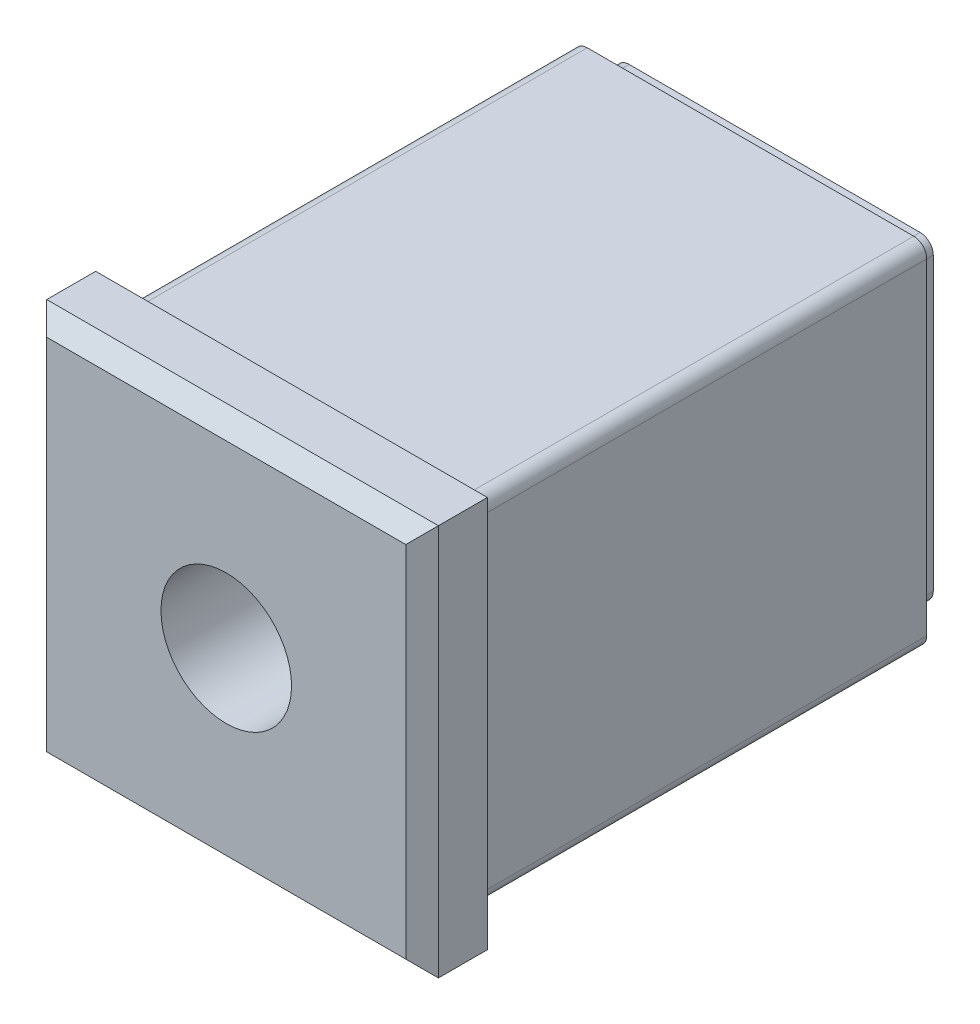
ISO-10303-21;
HEADER;
FILE_DESCRIPTION(('STEP AP214'),'2;1');
FILE_NAME('part.step','',(''),(''),'','','');
FILE_SCHEMA(('AUTOMOTIVE_DESIGN { 1 0 10303 214 1 1 1 1 }'));
ENDSEC;
DATA;
#1=APPLICATION_CONTEXT('core data for automotive mechanical design processes');
#2=APPLICATION_PROTOCOL_DEFINITION('international standard','automotive_design',2000,#1);
#3=PRODUCT_CONTEXT('',#1,'mechanical');
#4=PRODUCT('Part','Part','',(#3));
#5=PRODUCT_RELATED_PRODUCT_CATEGORY('part','',(#4));
#6=PRODUCT_DEFINITION_FORMATION('','',#4);
#7=PRODUCT_DEFINITION_CONTEXT('part definition',#1,'design');
#8=PRODUCT_DEFINITION('design','',#6,#7);
#9=PRODUCT_DEFINITION_SHAPE('','',#8);
#10=(LENGTH_UNIT() NAMED_UNIT(*) SI_UNIT(.MILLI.,.METRE.));
#11=(NAMED_UNIT(*) PLANE_ANGLE_UNIT() SI_UNIT($,.RADIAN.));
#12=(NAMED_UNIT(*) SI_UNIT($,.STERADIAN.) SOLID_ANGLE_UNIT());
#13=UNCERTAINTY_MEASURE_WITH_UNIT(LENGTH_MEASURE(1.E-05),#10,'distance_accuracy_value','');
#14=(GEOMETRIC_REPRESENTATION_CONTEXT(3) GLOBAL_UNCERTAINTY_ASSIGNED_CONTEXT((#13)) GLOBAL_UNIT_ASSIGNED_CONTEXT((#10,
#11,#12)) REPRESENTATION_CONTEXT('',''));
#15=CARTESIAN_POINT('',(0.,0.,0.));
#16=DIRECTION('',(0.,0.,1.));
#17=DIRECTION('',(1.,0.,0.));
#18=AXIS2_PLACEMENT_3D('',#15,#16,#17);
#19=CARTESIAN_POINT('',(13.75,0.,5.));
#20=DIRECTION('',(0.,0.,1.));
#21=DIRECTION('',(0.,1.,0.));
#22=AXIS2_PLACEMENT_3D('',#19,#20,#21);
#23=PLANE('',#22);
#24=DIRECTION('',(0.,-1.,0.));
#25=VECTOR('',#24,1.);
#26=CARTESIAN_POINT('',(-13.75,0.,5.));
#27=LINE('',#26,#25);
#28=CARTESIAN_POINT('',(-13.75,-13.75,5.));
#29=VERTEX_POINT('',#28);
#30=CARTESIAN_POINT('',(-13.75,13.75,5.));
#31=VERTEX_POINT('',#30);
#32=EDGE_CURVE('E237',#29,#31,#27,.F.);
#33=ORIENTED_EDGE('',*,*,#32,.F.);
#34=DIRECTION('',(-1.,0.,0.));
#35=VECTOR('',#34,1.);
#36=CARTESIAN_POINT('',(37.,-13.75,5.));
#37=LINE('',#36,#35);
#38=CARTESIAN_POINT('',(13.75,-13.75,5.));
#39=VERTEX_POINT('',#38);
#40=EDGE_CURVE('E188',#29,#39,#37,.F.);
#41=ORIENTED_EDGE('',*,*,#40,.T.);
#42=DIRECTION('',(0.,-1.,0.));
#43=VECTOR('',#42,1.);
#44=CARTESIAN_POINT('',(13.75,0.,5.));
#45=LINE('',#44,#43);
#46=CARTESIAN_POINT('',(13.75,13.75,5.));
#47=VERTEX_POINT('',#46);
#48=EDGE_CURVE('E347',#47,#39,#45,.T.);
#49=ORIENTED_EDGE('',*,*,#48,.F.);
#50=DIRECTION('',(-1.,0.,0.));
#51=VECTOR('',#50,1.);
#52=CARTESIAN_POINT('',(-30.,13.75,5.));
#53=LINE('',#52,#51);
#54=EDGE_CURVE('E360',#47,#31,#53,.T.);
#55=ORIENTED_EDGE('',*,*,#54,.T.);
#56=EDGE_LOOP('',(#33,#41,#49,#55));
#57=FACE_BOUND('',#56,.T.);
#58=CARTESIAN_POINT('',(0.,0.,5.));
#59=DIRECTION('',(0.,0.,1.));
#60=DIRECTION('',(0.,1.,0.));
#61=AXIS2_PLACEMENT_3D('',#58,#59,#60);
#62=CIRCLE('',#61,5.);
#63=CARTESIAN_POINT('',(0.,5.,5.));
#64=VERTEX_POINT('',#63);
#65=EDGE_CURVE('E191',#64,#64,#62,.F.);
#66=ORIENTED_EDGE('',*,*,#65,.T.);
#67=EDGE_LOOP('',(#66));
#68=FACE_BOUND('',#67,.T.);
#69=ADVANCED_FACE('F14',(#57,#68),#23,.T.);
#70=CARTESIAN_POINT('',(-30.,15.,3.75));
#71=DIRECTION('',(0.,-0.707106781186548,-0.707106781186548));
#72=DIRECTION('',(0.,-0.707106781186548,0.707106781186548));
#73=AXIS2_PLACEMENT_3D('',#70,#71,#72);
#74=PLANE('',#73);
#75=DIRECTION('',(-1.,0.,0.));
#76=VECTOR('',#75,1.);
#77=CARTESIAN_POINT('',(0.,15.,3.75));
#78=LINE('',#77,#76);
#79=CARTESIAN_POINT('',(15.,15.,3.75));
#80=VERTEX_POINT('',#79);
#81=CARTESIAN_POINT('',(-15.,15.,3.75));
#82=VERTEX_POINT('',#81);
#83=EDGE_CURVE('E338',#80,#82,#78,.T.);
#84=ORIENTED_EDGE('',*,*,#83,.T.);
#85=DIRECTION('',(-0.577350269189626,0.577350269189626,-0.577350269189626));
#86=VECTOR('',#85,1.);
#87=CARTESIAN_POINT('',(-13.75,13.75,5.));
#88=LINE('',#87,#86);
#89=EDGE_CURVE('E363',#31,#82,#88,.T.);
#90=ORIENTED_EDGE('',*,*,#89,.F.);
#91=ORIENTED_EDGE('',*,*,#54,.F.);
#92=DIRECTION('',(-0.577350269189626,-0.577350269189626,0.577350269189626));
#93=VECTOR('',#92,1.);
#94=CARTESIAN_POINT('',(15.,15.,3.75));
#95=LINE('',#94,#93);
#96=EDGE_CURVE('E349',#80,#47,#95,.T.);
#97=ORIENTED_EDGE('',*,*,#96,.F.);
#98=EDGE_LOOP('',(#84,#90,#91,#97));
#99=FACE_BOUND('',#98,.T.);
#100=ADVANCED_FACE('F441',(#99),#74,.F.);
#101=CARTESIAN_POINT('',(-13.75,0.,5.));
#102=DIRECTION('',(-0.707106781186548,0.,0.707106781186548));
#103=DIRECTION('',(-0.707106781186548,0.,-0.707106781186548));
#104=AXIS2_PLACEMENT_3D('',#101,#102,#103);
#105=PLANE('',#104);
#106=DIRECTION('',(0.,1.,0.));
#107=VECTOR('',#106,1.);
#108=CARTESIAN_POINT('',(-15.,0.,3.75));
#109=LINE('',#108,#107);
#110=CARTESIAN_POINT('',(-15.,-15.,3.75));
#111=VERTEX_POINT('',#110);
#112=EDGE_CURVE('E18',#111,#82,#109,.T.);
#113=ORIENTED_EDGE('',*,*,#112,.F.);
#114=DIRECTION('',(0.577350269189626,0.577350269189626,0.577350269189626));
#115=VECTOR('',#114,1.);
#116=CARTESIAN_POINT('',(-15.,-15.,3.75));
#117=LINE('',#116,#115);
#118=EDGE_CURVE('E164',#111,#29,#117,.T.);
#119=ORIENTED_EDGE('',*,*,#118,.T.);
#120=ORIENTED_EDGE('',*,*,#32,.T.);
#121=ORIENTED_EDGE('',*,*,#89,.T.);
#122=EDGE_LOOP('',(#113,#119,#120,#121));
#123=FACE_BOUND('',#122,.T.);
#124=ADVANCED_FACE('F443',(#123),#105,.T.);
#125=CARTESIAN_POINT('',(15.,0.,3.75));
#126=DIRECTION('',(0.707106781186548,0.,0.707106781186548));
#127=DIRECTION('',(-0.707106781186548,0.,0.707106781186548));
#128=AXIS2_PLACEMENT_3D('',#125,#126,#127);
#129=PLANE('',#128);
#130=ORIENTED_EDGE('',*,*,#48,.T.);
#131=DIRECTION('',(0.577350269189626,-0.577350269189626,-0.577350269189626));
#132=VECTOR('',#131,1.);
#133=CARTESIAN_POINT('',(13.75,-13.75,5.));
#134=LINE('',#133,#132);
#135=CARTESIAN_POINT('',(15.,-15.,3.75));
#136=VERTEX_POINT('',#135);
#137=EDGE_CURVE('E187',#39,#136,#134,.T.);
#138=ORIENTED_EDGE('',*,*,#137,.T.);
#139=DIRECTION('',(0.,-1.,0.));
#140=VECTOR('',#139,1.);
#141=CARTESIAN_POINT('',(15.,0.,3.75));
#142=LINE('',#141,#140);
#143=EDGE_CURVE('E333',#80,#136,#142,.T.);
#144=ORIENTED_EDGE('',*,*,#143,.F.);
#145=ORIENTED_EDGE('',*,*,#96,.T.);
#146=EDGE_LOOP('',(#130,#138,#144,#145));
#147=FACE_BOUND('',#146,.T.);
#148=ADVANCED_FACE('F446',(#147),#129,.T.);
#149=CARTESIAN_POINT('',(-15.,0.,-37.));
#150=DIRECTION('',(0.,0.,-1.));
#151=DIRECTION('',(0.,-1.,0.));
#152=AXIS2_PLACEMENT_3D('',#149,#150,#151);
#153=PLANE('',#152);
#154=DIRECTION('',(-1.,0.,0.));
#155=VECTOR('',#154,1.);
#156=CARTESIAN_POINT('',(-11.15,12.15,-37.));
#157=LINE('',#156,#155);
#158=CARTESIAN_POINT('',(-11.15,12.15,-37.));
#159=VERTEX_POINT('',#158);
#160=CARTESIAN_POINT('',(11.15,12.15,-37.));
#161=VERTEX_POINT('',#160);
#162=EDGE_CURVE('E322',#159,#161,#157,.F.);
#163=ORIENTED_EDGE('',*,*,#162,.T.);
#164=CARTESIAN_POINT('',(11.15,11.15,-37.));
#165=DIRECTION('',(0.,0.,1.));
#166=DIRECTION('',(0.,1.,0.));
#167=AXIS2_PLACEMENT_3D('',#164,#165,#166);
#168=CIRCLE('',#167,1.);
#169=CARTESIAN_POINT('',(12.15,11.15,-37.));
#170=VERTEX_POINT('',#169);
#171=EDGE_CURVE('E375',#161,#170,#168,.F.);
#172=ORIENTED_EDGE('',*,*,#171,.T.);
#173=DIRECTION('',(0.,1.,0.));
#174=VECTOR('',#173,1.);
#175=CARTESIAN_POINT('',(12.15,11.15,-37.));
#176=LINE('',#175,#174);
#177=CARTESIAN_POINT('',(12.15,-11.15,-37.));
#178=VERTEX_POINT('',#177);
#179=EDGE_CURVE('E327',#170,#178,#176,.F.);
#180=ORIENTED_EDGE('',*,*,#179,.T.);
#181=CARTESIAN_POINT('',(11.15,-11.15,-37.));
#182=DIRECTION('',(0.,0.,1.));
#183=DIRECTION('',(0.,1.,0.));
#184=AXIS2_PLACEMENT_3D('',#181,#182,#183);
#185=CIRCLE('',#184,1.);
#186=CARTESIAN_POINT('',(11.15,-12.15,-37.));
#187=VERTEX_POINT('',#186);
#188=EDGE_CURVE('E211',#178,#187,#185,.F.);
#189=ORIENTED_EDGE('',*,*,#188,.T.);
#190=DIRECTION('',(1.,0.,0.));
#191=VECTOR('',#190,1.);
#192=CARTESIAN_POINT('',(11.15,-12.15,-37.));
#193=LINE('',#192,#191);
#194=CARTESIAN_POINT('',(-11.15,-12.15,-37.));
#195=VERTEX_POINT('',#194);
#196=EDGE_CURVE('E181',#187,#195,#193,.F.);
#197=ORIENTED_EDGE('',*,*,#196,.T.);
#198=CARTESIAN_POINT('',(-11.15,-11.15,-37.));
#199=DIRECTION('',(0.,0.,1.));
#200=DIRECTION('',(0.,1.,0.));
#201=AXIS2_PLACEMENT_3D('',#198,#199,#200);
#202=CIRCLE('',#201,1.);
#203=CARTESIAN_POINT('',(-12.15,-11.15,-37.));
#204=VERTEX_POINT('',#203);
#205=EDGE_CURVE('E193',#195,#204,#202,.F.);
#206=ORIENTED_EDGE('',*,*,#205,.T.);
#207=DIRECTION('',(0.,-1.,0.));
#208=VECTOR('',#207,1.);
#209=CARTESIAN_POINT('',(-12.15,-11.15,-37.));
#210=LINE('',#209,#208);
#211=CARTESIAN_POINT('',(-12.15,11.15,-37.));
#212=VERTEX_POINT('',#211);
#213=EDGE_CURVE('E167',#204,#212,#210,.F.);
#214=ORIENTED_EDGE('',*,*,#213,.T.);
#215=CARTESIAN_POINT('',(-11.15,11.15,-37.));
#216=DIRECTION('',(0.,0.,1.));
#217=DIRECTION('',(0.,1.,0.));
#218=AXIS2_PLACEMENT_3D('',#215,#216,#217);
#219=CIRCLE('',#218,1.);
#220=EDGE_CURVE('E377',#212,#159,#219,.F.);
#221=ORIENTED_EDGE('',*,*,#220,.T.);
#222=EDGE_LOOP('',(#163,#172,#180,#189,#197,#206,#214,#221));
#223=FACE_BOUND('',#222,.T.);
#224=CARTESIAN_POINT('',(0.,0.,-37.));
#225=DIRECTION('',(0.,0.,-1.));
#226=DIRECTION('',(0.,-1.,0.));
#227=AXIS2_PLACEMENT_3D('',#224,#225,#226);
#228=CIRCLE('',#227,5.);
#229=CARTESIAN_POINT('',(0.,-5.,-37.));
#230=VERTEX_POINT('',#229);
#231=EDGE_CURVE('E651',#230,#230,#228,.T.);
#232=ORIENTED_EDGE('',*,*,#231,.F.);
#233=EDGE_LOOP('',(#232));
#234=FACE_BOUND('',#233,.T.);
#235=ADVANCED_FACE('F389',(#223,#234),#153,.T.);
#236=CARTESIAN_POINT('',(15.,0.,-37.));
#237=DIRECTION('',(1.,0.,0.));
#238=DIRECTION('',(0.,-1.,0.));
#239=AXIS2_PLACEMENT_3D('',#236,#237,#238);
#240=PLANE('',#239);
#241=ORIENTED_EDGE('',*,*,#143,.T.);
#242=DIRECTION('',(0.,0.,-1.));
#243=VECTOR('',#242,1.);
#244=CARTESIAN_POINT('',(15.,-15.,5.));
#245=LINE('',#244,#243);
#246=CARTESIAN_POINT('',(15.,-15.,0.));
#247=VERTEX_POINT('',#246);
#248=EDGE_CURVE('E174',#136,#247,#245,.T.);
#249=ORIENTED_EDGE('',*,*,#248,.T.);
#250=DIRECTION('',(0.,-1.,0.));
#251=VECTOR('',#250,1.);
#252=CARTESIAN_POINT('',(15.,0.,0.));
#253=LINE('',#252,#251);
#254=CARTESIAN_POINT('',(15.,15.,0.));
#255=VERTEX_POINT('',#254);
#256=EDGE_CURVE('E309',#255,#247,#253,.T.);
#257=ORIENTED_EDGE('',*,*,#256,.F.);
#258=DIRECTION('',(0.,0.,-1.));
#259=VECTOR('',#258,1.);
#260=CARTESIAN_POINT('',(15.,15.,-37.));
#261=LINE('',#260,#259);
#262=EDGE_CURVE('E337',#255,#80,#261,.F.);
#263=ORIENTED_EDGE('',*,*,#262,.T.);
#264=EDGE_LOOP('',(#241,#249,#257,#263));
#265=FACE_BOUND('',#264,.T.);
#266=ADVANCED_FACE('F467',(#265),#240,.T.);
#267=CARTESIAN_POINT('',(0.,15.,5.));
#268=DIRECTION('',(0.,-1.,0.));
#269=DIRECTION('',(-1.,0.,0.));
#270=AXIS2_PLACEMENT_3D('',#267,#268,#269);
#271=PLANE('',#270);
#272=DIRECTION('',(0.,0.,-1.));
#273=VECTOR('',#272,1.);
#274=CARTESIAN_POINT('',(-15.,15.,5.));
#275=LINE('',#274,#273);
#276=CARTESIAN_POINT('',(-15.,15.,0.));
#277=VERTEX_POINT('',#276);
#278=EDGE_CURVE('E334',#82,#277,#275,.T.);
#279=ORIENTED_EDGE('',*,*,#278,.F.);
#280=ORIENTED_EDGE('',*,*,#83,.F.);
#281=ORIENTED_EDGE('',*,*,#262,.F.);
#282=DIRECTION('',(-1.,0.,0.));
#283=VECTOR('',#282,1.);
#284=CARTESIAN_POINT('',(0.,15.,0.));
#285=LINE('',#284,#283);
#286=EDGE_CURVE('E312',#277,#255,#285,.F.);
#287=ORIENTED_EDGE('',*,*,#286,.F.);
#288=EDGE_LOOP('',(#279,#280,#281,#287));
#289=FACE_BOUND('',#288,.T.);
#290=ADVANCED_FACE('F470',(#289),#271,.F.);
#291=CARTESIAN_POINT('',(-15.,0.,3.75));
#292=DIRECTION('',(-1.,0.,0.));
#293=DIRECTION('',(0.,1.,0.));
#294=AXIS2_PLACEMENT_3D('',#291,#292,#293);
#295=PLANE('',#294);
#296=ORIENTED_EDGE('',*,*,#112,.T.);
#297=ORIENTED_EDGE('',*,*,#278,.T.);
#298=DIRECTION('',(0.,-1.,0.));
#299=VECTOR('',#298,1.);
#300=CARTESIAN_POINT('',(-15.,0.,0.));
#301=LINE('',#300,#299);
#302=CARTESIAN_POINT('',(-15.,-15.,0.));
#303=VERTEX_POINT('',#302);
#304=EDGE_CURVE('E315',#303,#277,#301,.F.);
#305=ORIENTED_EDGE('',*,*,#304,.F.);
#306=DIRECTION('',(0.,0.,-1.));
#307=VECTOR('',#306,1.);
#308=CARTESIAN_POINT('',(-15.,-15.,-37.));
#309=LINE('',#308,#307);
#310=EDGE_CURVE('E169',#303,#111,#309,.F.);
#311=ORIENTED_EDGE('',*,*,#310,.T.);
#312=EDGE_LOOP('',(#296,#297,#305,#311));
#313=FACE_BOUND('',#312,.T.);
#314=ADVANCED_FACE('F474',(#313),#295,.T.);
#315=CARTESIAN_POINT('',(-12.5,13.5,0.));
#316=DIRECTION('',(0.,-1.,0.));
#317=DIRECTION('',(-1.,0.,0.));
#318=AXIS2_PLACEMENT_3D('',#315,#316,#317);
#319=PLANE('',#318);
#320=DIRECTION('',(0.,0.,-1.));
#321=VECTOR('',#320,1.);
#322=CARTESIAN_POINT('',(-12.5,13.5,0.));
#323=LINE('',#322,#321);
#324=CARTESIAN_POINT('',(-12.5,13.5,0.));
#325=VERTEX_POINT('',#324);
#326=CARTESIAN_POINT('',(-12.5,13.5,-35.15));
#327=VERTEX_POINT('',#326);
#328=EDGE_CURVE('E24',#325,#327,#323,.T.);
#329=ORIENTED_EDGE('',*,*,#328,.F.);
#330=DIRECTION('',(-1.,0.,0.));
#331=VECTOR('',#330,1.);
#332=CARTESIAN_POINT('',(-12.5,13.5,0.));
#333=LINE('',#332,#331);
#334=CARTESIAN_POINT('',(12.5,13.5,0.));
#335=VERTEX_POINT('',#334);
#336=EDGE_CURVE('E279',#335,#325,#333,.T.);
#337=ORIENTED_EDGE('',*,*,#336,.F.);
#338=DIRECTION('',(0.,0.,-1.));
#339=VECTOR('',#338,1.);
#340=CARTESIAN_POINT('',(12.5,13.5,0.));
#341=LINE('',#340,#339);
#342=CARTESIAN_POINT('',(12.5,13.5,-35.15));
#343=VERTEX_POINT('',#342);
#344=EDGE_CURVE('E276',#343,#335,#341,.F.);
#345=ORIENTED_EDGE('',*,*,#344,.F.);
#346=DIRECTION('',(-1.,0.,0.));
#347=VECTOR('',#346,1.);
#348=CARTESIAN_POINT('',(-12.5,13.5,-35.15));
#349=LINE('',#348,#347);
#350=EDGE_CURVE('E9',#327,#343,#349,.F.);
#351=ORIENTED_EDGE('',*,*,#350,.F.);
#352=EDGE_LOOP('',(#329,#337,#345,#351));
#353=FACE_BOUND('',#352,.T.);
#354=ADVANCED_FACE('F477',(#353),#319,.F.);
#355=CARTESIAN_POINT('',(-12.5,12.5,0.));
#356=DIRECTION('',(0.,0.,1.));
#357=DIRECTION('',(0.,1.,0.));
#358=AXIS2_PLACEMENT_3D('',#355,#356,#357);
#359=CYLINDRICAL_SURFACE('',#358,1.);
#360=CARTESIAN_POINT('',(-12.5,12.5,0.));
#361=DIRECTION('',(0.,0.,1.));
#362=DIRECTION('',(0.,1.,0.));
#363=AXIS2_PLACEMENT_3D('',#360,#361,#362);
#364=CIRCLE('',#363,1.);
#365=CARTESIAN_POINT('',(-13.5,12.5,0.));
#366=VERTEX_POINT('',#365);
#367=EDGE_CURVE('E295',#366,#325,#364,.F.);
#368=ORIENTED_EDGE('',*,*,#367,.T.);
#369=ORIENTED_EDGE('',*,*,#328,.T.);
#370=CARTESIAN_POINT('',(-12.5,12.5,-35.15));
#371=DIRECTION('',(0.,0.,1.));
#372=DIRECTION('',(0.,1.,0.));
#373=AXIS2_PLACEMENT_3D('',#370,#371,#372);
#374=CIRCLE('',#373,1.);
#375=CARTESIAN_POINT('',(-13.5,12.5,-35.15));
#376=VERTEX_POINT('',#375);
#377=EDGE_CURVE('E32',#376,#327,#374,.F.);
#378=ORIENTED_EDGE('',*,*,#377,.F.);
#379=DIRECTION('',(0.,0.,1.));
#380=VECTOR('',#379,1.);
#381=CARTESIAN_POINT('',(-13.5,12.5,0.));
#382=LINE('',#381,#380);
#383=EDGE_CURVE('E304',#376,#366,#382,.T.);
#384=ORIENTED_EDGE('',*,*,#383,.T.);
#385=EDGE_LOOP('',(#368,#369,#378,#384));
#386=FACE_BOUND('',#385,.T.);
#387=ADVANCED_FACE('F512',(#386),#359,.T.);
#388=CARTESIAN_POINT('',(-13.5,-12.5,0.));
#389=DIRECTION('',(1.,0.,0.));
#390=DIRECTION('',(0.,-1.,0.));
#391=AXIS2_PLACEMENT_3D('',#388,#389,#390);
#392=PLANE('',#391);
#393=DIRECTION('',(0.,-1.,0.));
#394=VECTOR('',#393,1.);
#395=CARTESIAN_POINT('',(-13.5,0.,-35.15));
#396=LINE('',#395,#394);
#397=CARTESIAN_POINT('',(-13.5,-12.5,-35.15));
#398=VERTEX_POINT('',#397);
#399=EDGE_CURVE('E153',#398,#376,#396,.F.);
#400=ORIENTED_EDGE('',*,*,#399,.F.);
#401=DIRECTION('',(0.,0.,1.));
#402=VECTOR('',#401,1.);
#403=CARTESIAN_POINT('',(-13.5,-12.5,0.));
#404=LINE('',#403,#402);
#405=CARTESIAN_POINT('',(-13.5,-12.5,0.));
#406=VERTEX_POINT('',#405);
#407=EDGE_CURVE('E244',#406,#398,#404,.F.);
#408=ORIENTED_EDGE('',*,*,#407,.F.);
#409=DIRECTION('',(0.,-1.,0.));
#410=VECTOR('',#409,1.);
#411=CARTESIAN_POINT('',(-13.5,0.,0.));
#412=LINE('',#411,#410);
#413=EDGE_CURVE('E302',#366,#406,#412,.T.);
#414=ORIENTED_EDGE('',*,*,#413,.F.);
#415=ORIENTED_EDGE('',*,*,#383,.F.);
#416=EDGE_LOOP('',(#400,#408,#414,#415));
#417=FACE_BOUND('',#416,.T.);
#418=ADVANCED_FACE('F405',(#417),#392,.F.);
#419=CARTESIAN_POINT('',(-12.15,-11.15,-35.15));
#420=DIRECTION('',(1.,0.,0.));
#421=DIRECTION('',(0.,-1.,0.));
#422=AXIS2_PLACEMENT_3D('',#419,#420,#421);
#423=PLANE('',#422);
#424=ORIENTED_EDGE('',*,*,#213,.F.);
#425=DIRECTION('',(0.,0.,-1.));
#426=VECTOR('',#425,1.);
#427=CARTESIAN_POINT('',(-12.15,-11.15,-35.15));
#428=LINE('',#427,#426);
#429=CARTESIAN_POINT('',(-12.15,-11.15,-35.15));
#430=VERTEX_POINT('',#429);
#431=EDGE_CURVE('E160',#430,#204,#428,.T.);
#432=ORIENTED_EDGE('',*,*,#431,.F.);
#433=DIRECTION('',(0.,-1.,0.));
#434=VECTOR('',#433,1.);
#435=CARTESIAN_POINT('',(-12.15,0.,-35.15));
#436=LINE('',#435,#434);
#437=CARTESIAN_POINT('',(-12.15,11.15,-35.15));
#438=VERTEX_POINT('',#437);
#439=EDGE_CURVE('E146',#438,#430,#436,.T.);
#440=ORIENTED_EDGE('',*,*,#439,.F.);
#441=DIRECTION('',(0.,0.,-1.));
#442=VECTOR('',#441,1.);
#443=CARTESIAN_POINT('',(-12.15,11.15,-35.15));
#444=LINE('',#443,#442);
#445=EDGE_CURVE('E320',#212,#438,#444,.F.);
#446=ORIENTED_EDGE('',*,*,#445,.F.);
#447=EDGE_LOOP('',(#424,#432,#440,#446));
#448=FACE_BOUND('',#447,.T.);
#449=ADVANCED_FACE('F165',(#448),#423,.F.);
#450=CARTESIAN_POINT('',(-11.15,11.15,-35.15));
#451=DIRECTION('',(0.,0.,1.));
#452=DIRECTION('',(0.,1.,0.));
#453=AXIS2_PLACEMENT_3D('',#450,#451,#452);
#454=CYLINDRICAL_SURFACE('',#453,1.);
#455=CARTESIAN_POINT('',(-11.15,11.15,-35.15));
#456=DIRECTION('',(0.,0.,1.));
#457=DIRECTION('',(0.,1.,0.));
#458=AXIS2_PLACEMENT_3D('',#455,#456,#457);
#459=CIRCLE('',#458,1.);
#460=CARTESIAN_POINT('',(-11.15,12.15,-35.15));
#461=VERTEX_POINT('',#460);
#462=EDGE_CURVE('E149',#438,#461,#459,.F.);
#463=ORIENTED_EDGE('',*,*,#462,.T.);
#464=DIRECTION('',(0.,0.,-1.));
#465=VECTOR('',#464,1.);
#466=CARTESIAN_POINT('',(-11.15,12.15,-35.15));
#467=LINE('',#466,#465);
#468=EDGE_CURVE('E326',#461,#159,#467,.T.);
#469=ORIENTED_EDGE('',*,*,#468,.T.);
#470=ORIENTED_EDGE('',*,*,#220,.F.);
#471=ORIENTED_EDGE('',*,*,#445,.T.);
#472=EDGE_LOOP('',(#463,#469,#470,#471));
#473=FACE_BOUND('',#472,.T.);
#474=ADVANCED_FACE('F395',(#473),#454,.T.);
#475=CARTESIAN_POINT('',(-11.15,12.15,-35.15));
#476=DIRECTION('',(0.,-1.,0.));
#477=DIRECTION('',(-1.,0.,0.));
#478=AXIS2_PLACEMENT_3D('',#475,#476,#477);
#479=PLANE('',#478);
#480=ORIENTED_EDGE('',*,*,#468,.F.);
#481=DIRECTION('',(-1.,0.,0.));
#482=VECTOR('',#481,1.);
#483=CARTESIAN_POINT('',(0.,12.15,-35.15));
#484=LINE('',#483,#482);
#485=CARTESIAN_POINT('',(11.15,12.15,-35.15));
#486=VERTEX_POINT('',#485);
#487=EDGE_CURVE('E154',#486,#461,#484,.T.);
#488=ORIENTED_EDGE('',*,*,#487,.F.);
#489=DIRECTION('',(0.,0.,-1.));
#490=VECTOR('',#489,1.);
#491=CARTESIAN_POINT('',(11.15,12.15,-35.15));
#492=LINE('',#491,#490);
#493=EDGE_CURVE('E323',#161,#486,#492,.F.);
#494=ORIENTED_EDGE('',*,*,#493,.F.);
#495=ORIENTED_EDGE('',*,*,#162,.F.);
#496=EDGE_LOOP('',(#480,#488,#494,#495));
#497=FACE_BOUND('',#496,.T.);
#498=ADVANCED_FACE('F394',(#497),#479,.F.);
#499=CARTESIAN_POINT('',(11.15,11.15,-35.15));
#500=DIRECTION('',(0.,0.,1.));
#501=DIRECTION('',(0.,1.,0.));
#502=AXIS2_PLACEMENT_3D('',#499,#500,#501);
#503=CYLINDRICAL_SURFACE('',#502,1.);
#504=CARTESIAN_POINT('',(11.15,11.15,-35.15));
#505=DIRECTION('',(0.,0.,1.));
#506=DIRECTION('',(0.,1.,0.));
#507=AXIS2_PLACEMENT_3D('',#504,#505,#506);
#508=CIRCLE('',#507,1.);
#509=CARTESIAN_POINT('',(12.15,11.15,-35.15));
#510=VERTEX_POINT('',#509);
#511=EDGE_CURVE('E228',#486,#510,#508,.F.);
#512=ORIENTED_EDGE('',*,*,#511,.T.);
#513=DIRECTION('',(0.,0.,-1.));
#514=VECTOR('',#513,1.);
#515=CARTESIAN_POINT('',(12.15,11.15,-35.15));
#516=LINE('',#515,#514);
#517=EDGE_CURVE('E330',#510,#170,#516,.T.);
#518=ORIENTED_EDGE('',*,*,#517,.T.);
#519=ORIENTED_EDGE('',*,*,#171,.F.);
#520=ORIENTED_EDGE('',*,*,#493,.T.);
#521=EDGE_LOOP('',(#512,#518,#519,#520));
#522=FACE_BOUND('',#521,.T.);
#523=ADVANCED_FACE('F382',(#522),#503,.T.);
#524=CARTESIAN_POINT('',(12.15,11.15,-35.15));
#525=DIRECTION('',(-1.,0.,0.));
#526=DIRECTION('',(0.,1.,0.));
#527=AXIS2_PLACEMENT_3D('',#524,#525,#526);
#528=PLANE('',#527);
#529=ORIENTED_EDGE('',*,*,#517,.F.);
#530=DIRECTION('',(0.,-1.,0.));
#531=VECTOR('',#530,1.);
#532=CARTESIAN_POINT('',(12.15,0.,-35.15));
#533=LINE('',#532,#531);
#534=CARTESIAN_POINT('',(12.15,-11.15,-35.15));
#535=VERTEX_POINT('',#534);
#536=EDGE_CURVE('E293',#535,#510,#533,.F.);
#537=ORIENTED_EDGE('',*,*,#536,.F.);
#538=DIRECTION('',(0.,0.,-1.));
#539=VECTOR('',#538,1.);
#540=CARTESIAN_POINT('',(12.15,-11.15,-35.15));
#541=LINE('',#540,#539);
#542=EDGE_CURVE('E184',#178,#535,#541,.F.);
#543=ORIENTED_EDGE('',*,*,#542,.F.);
#544=ORIENTED_EDGE('',*,*,#179,.F.);
#545=EDGE_LOOP('',(#529,#537,#543,#544));
#546=FACE_BOUND('',#545,.T.);
#547=ADVANCED_FACE('F387',(#546),#528,.F.);
#548=CARTESIAN_POINT('',(13.5,12.5,0.));
#549=DIRECTION('',(-1.,0.,0.));
#550=DIRECTION('',(0.,1.,0.));
#551=AXIS2_PLACEMENT_3D('',#548,#549,#550);
#552=PLANE('',#551);
#553=DIRECTION('',(0.,0.,1.));
#554=VECTOR('',#553,1.);
#555=CARTESIAN_POINT('',(13.5,12.5,0.));
#556=LINE('',#555,#554);
#557=CARTESIAN_POINT('',(13.5,12.5,0.));
#558=VERTEX_POINT('',#557);
#559=CARTESIAN_POINT('',(13.5,12.5,-35.15));
#560=VERTEX_POINT('',#559);
#561=EDGE_CURVE('E316',#558,#560,#556,.F.);
#562=ORIENTED_EDGE('',*,*,#561,.F.);
#563=DIRECTION('',(0.,-1.,0.));
#564=VECTOR('',#563,1.);
#565=CARTESIAN_POINT('',(13.5,0.,0.));
#566=LINE('',#565,#564);
#567=CARTESIAN_POINT('',(13.5,-12.5,0.));
#568=VERTEX_POINT('',#567);
#569=EDGE_CURVE('E260',#568,#558,#566,.F.);
#570=ORIENTED_EDGE('',*,*,#569,.F.);
#571=DIRECTION('',(0.,0.,1.));
#572=VECTOR('',#571,1.);
#573=CARTESIAN_POINT('',(13.5,-12.5,0.));
#574=LINE('',#573,#572);
#575=CARTESIAN_POINT('',(13.5,-12.5,-35.15));
#576=VERTEX_POINT('',#575);
#577=EDGE_CURVE('E206',#576,#568,#574,.T.);
#578=ORIENTED_EDGE('',*,*,#577,.F.);
#579=DIRECTION('',(0.,-1.,0.));
#580=VECTOR('',#579,1.);
#581=CARTESIAN_POINT('',(13.5,0.,-35.15));
#582=LINE('',#581,#580);
#583=EDGE_CURVE('E272',#560,#576,#582,.T.);
#584=ORIENTED_EDGE('',*,*,#583,.F.);
#585=EDGE_LOOP('',(#562,#570,#578,#584));
#586=FACE_BOUND('',#585,.T.);
#587=ADVANCED_FACE('F458',(#586),#552,.F.);
#588=CARTESIAN_POINT('',(12.5,12.5,0.));
#589=DIRECTION('',(0.,0.,1.));
#590=DIRECTION('',(0.,1.,0.));
#591=AXIS2_PLACEMENT_3D('',#588,#589,#590);
#592=CYLINDRICAL_SURFACE('',#591,1.);
#593=CARTESIAN_POINT('',(12.5,12.5,0.));
#594=DIRECTION('',(0.,0.,1.));
#595=DIRECTION('',(0.,1.,0.));
#596=AXIS2_PLACEMENT_3D('',#593,#594,#595);
#597=CIRCLE('',#596,1.);
#598=EDGE_CURVE('E305',#558,#335,#597,.T.);
#599=ORIENTED_EDGE('',*,*,#598,.F.);
#600=ORIENTED_EDGE('',*,*,#561,.T.);
#601=CARTESIAN_POINT('',(12.5,12.5,-35.15));
#602=DIRECTION('',(0.,0.,1.));
#603=DIRECTION('',(0.,1.,0.));
#604=AXIS2_PLACEMENT_3D('',#601,#602,#603);
#605=CIRCLE('',#604,1.);
#606=EDGE_CURVE('E275',#343,#560,#605,.F.);
#607=ORIENTED_EDGE('',*,*,#606,.F.);
#608=ORIENTED_EDGE('',*,*,#344,.T.);
#609=EDGE_LOOP('',(#599,#600,#607,#608));
#610=FACE_BOUND('',#609,.T.);
#611=ADVANCED_FACE('F464',(#610),#592,.T.);
#612=CARTESIAN_POINT('',(0.,0.,-35.15));
#613=DIRECTION('',(0.,0.,-1.));
#614=DIRECTION('',(0.,-1.,0.));
#615=AXIS2_PLACEMENT_3D('',#612,#613,#614);
#616=PLANE('',#615);
#617=ORIENTED_EDGE('',*,*,#439,.T.);
#618=CARTESIAN_POINT('',(-11.15,-11.15,-35.15));
#619=DIRECTION('',(0.,0.,1.));
#620=DIRECTION('',(0.,1.,0.));
#621=AXIS2_PLACEMENT_3D('',#618,#619,#620);
#622=CIRCLE('',#621,1.);
#623=CARTESIAN_POINT('',(-11.15,-12.15,-35.15));
#624=VERTEX_POINT('',#623);
#625=EDGE_CURVE('E143',#624,#430,#622,.F.);
#626=ORIENTED_EDGE('',*,*,#625,.F.);
#627=DIRECTION('',(-1.,0.,0.));
#628=VECTOR('',#627,1.);
#629=CARTESIAN_POINT('',(0.,-12.15,-35.15));
#630=LINE('',#629,#628);
#631=CARTESIAN_POINT('',(11.15,-12.15,-35.15));
#632=VERTEX_POINT('',#631);
#633=EDGE_CURVE('E203',#624,#632,#630,.F.);
#634=ORIENTED_EDGE('',*,*,#633,.T.);
#635=CARTESIAN_POINT('',(11.15,-11.15,-35.15));
#636=DIRECTION('',(0.,0.,1.));
#637=DIRECTION('',(0.,1.,0.));
#638=AXIS2_PLACEMENT_3D('',#635,#636,#637);
#639=CIRCLE('',#638,1.);
#640=EDGE_CURVE('E163',#535,#632,#639,.F.);
#641=ORIENTED_EDGE('',*,*,#640,.F.);
#642=ORIENTED_EDGE('',*,*,#536,.T.);
#643=ORIENTED_EDGE('',*,*,#511,.F.);
#644=ORIENTED_EDGE('',*,*,#487,.T.);
#645=ORIENTED_EDGE('',*,*,#462,.F.);
#646=EDGE_LOOP('',(#617,#626,#634,#641,#642,#643,#644,#645));
#647=FACE_BOUND('',#646,.T.);
#648=ORIENTED_EDGE('',*,*,#606,.T.);
#649=ORIENTED_EDGE('',*,*,#583,.T.);
#650=CARTESIAN_POINT('',(12.5,-12.5,-35.15));
#651=DIRECTION('',(0.,0.,1.));
#652=DIRECTION('',(0.,1.,0.));
#653=AXIS2_PLACEMENT_3D('',#650,#651,#652);
#654=CIRCLE('',#653,1.);
#655=CARTESIAN_POINT('',(12.5,-13.5,-35.15));
#656=VERTEX_POINT('',#655);
#657=EDGE_CURVE('E201',#576,#656,#654,.F.);
#658=ORIENTED_EDGE('',*,*,#657,.T.);
#659=DIRECTION('',(1.,0.,0.));
#660=VECTOR('',#659,1.);
#661=CARTESIAN_POINT('',(12.5,-13.5,-35.15));
#662=LINE('',#661,#660);
#663=CARTESIAN_POINT('',(-12.5,-13.5,-35.15));
#664=VERTEX_POINT('',#663);
#665=EDGE_CURVE('E233',#656,#664,#662,.F.);
#666=ORIENTED_EDGE('',*,*,#665,.T.);
#667=CARTESIAN_POINT('',(-12.5,-12.5,-35.15));
#668=DIRECTION('',(0.,0.,1.));
#669=DIRECTION('',(0.,1.,0.));
#670=AXIS2_PLACEMENT_3D('',#667,#668,#669);
#671=CIRCLE('',#670,1.);
#672=EDGE_CURVE('E197',#664,#398,#671,.F.);
#673=ORIENTED_EDGE('',*,*,#672,.T.);
#674=ORIENTED_EDGE('',*,*,#399,.T.);
#675=ORIENTED_EDGE('',*,*,#377,.T.);
#676=ORIENTED_EDGE('',*,*,#350,.T.);
#677=EDGE_LOOP('',(#648,#649,#658,#666,#673,#674,#675,#676));
#678=FACE_BOUND('',#677,.T.);
#679=ADVANCED_FACE('F147',(#647,#678),#616,.T.);
#680=CARTESIAN_POINT('',(0.,0.,0.));
#681=DIRECTION('',(0.,0.,-1.));
#682=DIRECTION('',(0.,-1.,0.));
#683=AXIS2_PLACEMENT_3D('',#680,#681,#682);
#684=PLANE('',#683);
#685=ORIENTED_EDGE('',*,*,#413,.T.);
#686=CARTESIAN_POINT('',(-12.5,-12.5,0.));
#687=DIRECTION('',(0.,0.,1.));
#688=DIRECTION('',(0.,1.,0.));
#689=AXIS2_PLACEMENT_3D('',#686,#687,#688);
#690=CIRCLE('',#689,1.);
#691=CARTESIAN_POINT('',(-12.5,-13.5,0.));
#692=VERTEX_POINT('',#691);
#693=EDGE_CURVE('E207',#406,#692,#690,.T.);
#694=ORIENTED_EDGE('',*,*,#693,.T.);
#695=DIRECTION('',(1.,0.,0.));
#696=VECTOR('',#695,1.);
#697=CARTESIAN_POINT('',(12.5,-13.5,0.));
#698=LINE('',#697,#696);
#699=CARTESIAN_POINT('',(12.5,-13.5,0.));
#700=VERTEX_POINT('',#699);
#701=EDGE_CURVE('E234',#692,#700,#698,.T.);
#702=ORIENTED_EDGE('',*,*,#701,.T.);
#703=CARTESIAN_POINT('',(12.5,-12.5,0.));
#704=DIRECTION('',(0.,0.,1.));
#705=DIRECTION('',(0.,1.,0.));
#706=AXIS2_PLACEMENT_3D('',#703,#704,#705);
#707=CIRCLE('',#706,1.);
#708=EDGE_CURVE('E204',#568,#700,#707,.F.);
#709=ORIENTED_EDGE('',*,*,#708,.F.);
#710=ORIENTED_EDGE('',*,*,#569,.T.);
#711=ORIENTED_EDGE('',*,*,#598,.T.);
#712=ORIENTED_EDGE('',*,*,#336,.T.);
#713=ORIENTED_EDGE('',*,*,#367,.F.);
#714=EDGE_LOOP('',(#685,#694,#702,#709,#710,#711,#712,#713));
#715=FACE_BOUND('',#714,.T.);
#716=DIRECTION('',(-1.,0.,0.));
#717=VECTOR('',#716,1.);
#718=CARTESIAN_POINT('',(0.,-15.,0.));
#719=LINE('',#718,#717);
#720=EDGE_CURVE('E209',#247,#303,#719,.T.);
#721=ORIENTED_EDGE('',*,*,#720,.T.);
#722=ORIENTED_EDGE('',*,*,#304,.T.);
#723=ORIENTED_EDGE('',*,*,#286,.T.);
#724=ORIENTED_EDGE('',*,*,#256,.T.);
#725=EDGE_LOOP('',(#721,#722,#723,#724));
#726=FACE_BOUND('',#725,.T.);
#727=ADVANCED_FACE('F258',(#715,#726),#684,.T.);
#728=CARTESIAN_POINT('',(37.,-15.,3.75));
#729=DIRECTION('',(0.,0.707106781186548,-0.707106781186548));
#730=DIRECTION('',(0.,-0.707106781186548,-0.707106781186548));
#731=AXIS2_PLACEMENT_3D('',#728,#729,#730);
#732=PLANE('',#731);
#733=DIRECTION('',(1.,0.,0.));
#734=VECTOR('',#733,1.);
#735=CARTESIAN_POINT('',(0.,-15.,3.75));
#736=LINE('',#735,#734);
#737=EDGE_CURVE('E180',#111,#136,#736,.T.);
#738=ORIENTED_EDGE('',*,*,#737,.T.);
#739=ORIENTED_EDGE('',*,*,#137,.F.);
#740=ORIENTED_EDGE('',*,*,#40,.F.);
#741=ORIENTED_EDGE('',*,*,#118,.F.);
#742=EDGE_LOOP('',(#738,#739,#740,#741));
#743=FACE_BOUND('',#742,.T.);
#744=ADVANCED_FACE('F16',(#743),#732,.F.);
#745=CARTESIAN_POINT('',(0.,-15.,5.));
#746=DIRECTION('',(0.,1.,0.));
#747=DIRECTION('',(1.,0.,0.));
#748=AXIS2_PLACEMENT_3D('',#745,#746,#747);
#749=PLANE('',#748);
#750=ORIENTED_EDGE('',*,*,#248,.F.);
#751=ORIENTED_EDGE('',*,*,#737,.F.);
#752=ORIENTED_EDGE('',*,*,#310,.F.);
#753=ORIENTED_EDGE('',*,*,#720,.F.);
#754=EDGE_LOOP('',(#750,#751,#752,#753));
#755=FACE_BOUND('',#754,.T.);
#756=ADVANCED_FACE('F410',(#755),#749,.F.);
#757=CARTESIAN_POINT('',(12.5,-13.5,0.));
#758=DIRECTION('',(0.,1.,0.));
#759=DIRECTION('',(1.,0.,0.));
#760=AXIS2_PLACEMENT_3D('',#757,#758,#759);
#761=PLANE('',#760);
#762=DIRECTION('',(0.,0.,-1.));
#763=VECTOR('',#762,1.);
#764=CARTESIAN_POINT('',(12.5,-13.5,0.));
#765=LINE('',#764,#763);
#766=EDGE_CURVE('E230',#700,#656,#765,.T.);
#767=ORIENTED_EDGE('',*,*,#766,.F.);
#768=ORIENTED_EDGE('',*,*,#701,.F.);
#769=DIRECTION('',(0.,0.,-1.));
#770=VECTOR('',#769,1.);
#771=CARTESIAN_POINT('',(-12.5,-13.5,0.));
#772=LINE('',#771,#770);
#773=EDGE_CURVE('E200',#664,#692,#772,.F.);
#774=ORIENTED_EDGE('',*,*,#773,.F.);
#775=ORIENTED_EDGE('',*,*,#665,.F.);
#776=EDGE_LOOP('',(#767,#768,#774,#775));
#777=FACE_BOUND('',#776,.T.);
#778=ADVANCED_FACE('F265',(#777),#761,.F.);
#779=CARTESIAN_POINT('',(12.5,-12.5,0.));
#780=DIRECTION('',(0.,0.,1.));
#781=DIRECTION('',(0.,1.,0.));
#782=AXIS2_PLACEMENT_3D('',#779,#780,#781);
#783=CYLINDRICAL_SURFACE('',#782,1.);
#784=ORIENTED_EDGE('',*,*,#708,.T.);
#785=ORIENTED_EDGE('',*,*,#766,.T.);
#786=ORIENTED_EDGE('',*,*,#657,.F.);
#787=ORIENTED_EDGE('',*,*,#577,.T.);
#788=EDGE_LOOP('',(#784,#785,#786,#787));
#789=FACE_BOUND('',#788,.T.);
#790=ADVANCED_FACE('F253',(#789),#783,.T.);
#791=CARTESIAN_POINT('',(11.15,-11.15,-35.15));
#792=DIRECTION('',(0.,0.,1.));
#793=DIRECTION('',(0.,1.,0.));
#794=AXIS2_PLACEMENT_3D('',#791,#792,#793);
#795=CYLINDRICAL_SURFACE('',#794,1.);
#796=ORIENTED_EDGE('',*,*,#640,.T.);
#797=DIRECTION('',(0.,0.,-1.));
#798=VECTOR('',#797,1.);
#799=CARTESIAN_POINT('',(11.15,-12.15,-35.15));
#800=LINE('',#799,#798);
#801=EDGE_CURVE('E171',#632,#187,#800,.T.);
#802=ORIENTED_EDGE('',*,*,#801,.T.);
#803=ORIENTED_EDGE('',*,*,#188,.F.);
#804=ORIENTED_EDGE('',*,*,#542,.T.);
#805=EDGE_LOOP('',(#796,#802,#803,#804));
#806=FACE_BOUND('',#805,.T.);
#807=ADVANCED_FACE('F218',(#806),#795,.T.);
#808=CARTESIAN_POINT('',(11.15,-12.15,-35.15));
#809=DIRECTION('',(0.,1.,0.));
#810=DIRECTION('',(1.,0.,0.));
#811=AXIS2_PLACEMENT_3D('',#808,#809,#810);
#812=PLANE('',#811);
#813=ORIENTED_EDGE('',*,*,#801,.F.);
#814=ORIENTED_EDGE('',*,*,#633,.F.);
#815=DIRECTION('',(0.,0.,-1.));
#816=VECTOR('',#815,1.);
#817=CARTESIAN_POINT('',(-11.15,-12.15,-35.15));
#818=LINE('',#817,#816);
#819=EDGE_CURVE('E161',#195,#624,#818,.F.);
#820=ORIENTED_EDGE('',*,*,#819,.F.);
#821=ORIENTED_EDGE('',*,*,#196,.F.);
#822=EDGE_LOOP('',(#813,#814,#820,#821));
#823=FACE_BOUND('',#822,.T.);
#824=ADVANCED_FACE('F224',(#823),#812,.F.);
#825=CARTESIAN_POINT('',(-11.15,-11.15,-35.15));
#826=DIRECTION('',(0.,0.,1.));
#827=DIRECTION('',(0.,1.,0.));
#828=AXIS2_PLACEMENT_3D('',#825,#826,#827);
#829=CYLINDRICAL_SURFACE('',#828,1.);
#830=ORIENTED_EDGE('',*,*,#625,.T.);
#831=ORIENTED_EDGE('',*,*,#431,.T.);
#832=ORIENTED_EDGE('',*,*,#205,.F.);
#833=ORIENTED_EDGE('',*,*,#819,.T.);
#834=EDGE_LOOP('',(#830,#831,#832,#833));
#835=FACE_BOUND('',#834,.T.);
#836=ADVANCED_FACE('F158',(#835),#829,.T.);
#837=CARTESIAN_POINT('',(-12.5,-12.5,0.));
#838=DIRECTION('',(0.,0.,1.));
#839=DIRECTION('',(0.,1.,0.));
#840=AXIS2_PLACEMENT_3D('',#837,#838,#839);
#841=CYLINDRICAL_SURFACE('',#840,1.);
#842=ORIENTED_EDGE('',*,*,#693,.F.);
#843=ORIENTED_EDGE('',*,*,#407,.T.);
#844=ORIENTED_EDGE('',*,*,#672,.F.);
#845=ORIENTED_EDGE('',*,*,#773,.T.);
#846=EDGE_LOOP('',(#842,#843,#844,#845));
#847=FACE_BOUND('',#846,.T.);
#848=ADVANCED_FACE('F269',(#847),#841,.T.);
#849=CARTESIAN_POINT('',(0.,0.,36.7785688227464));
#850=DIRECTION('',(0.,0.,-1.));
#851=DIRECTION('',(0.,-1.,0.));
#852=AXIS2_PLACEMENT_3D('',#849,#850,#851);
#853=CYLINDRICAL_SURFACE('',#852,5.);
#854=ORIENTED_EDGE('',*,*,#231,.T.);
#855=EDGE_LOOP('',(#854));
#856=FACE_BOUND('',#855,.T.);
#857=ORIENTED_EDGE('',*,*,#65,.F.);
#858=EDGE_LOOP('',(#857));
#859=FACE_BOUND('',#858,.T.);
#860=ADVANCED_FACE('F420',(#856,#859),#853,.F.);
#861=CLOSED_SHELL('',(#69,#100,#124,#148,#235,#266,#290,#314,#354,#387,#418,#449,#474,#498,#523,
#547,#587,#611,#679,#727,#744,#756,#778,#790,#807,#824,#836,#848,#860));
#862=MANIFOLD_SOLID_BREP('B1',#861);
#863=ADVANCED_BREP_SHAPE_REPRESENTATION('',(#18,#862),#14);
#864=SHAPE_DEFINITION_REPRESENTATION(#9,#863);
ENDSEC;
END-ISO-10303-21;
